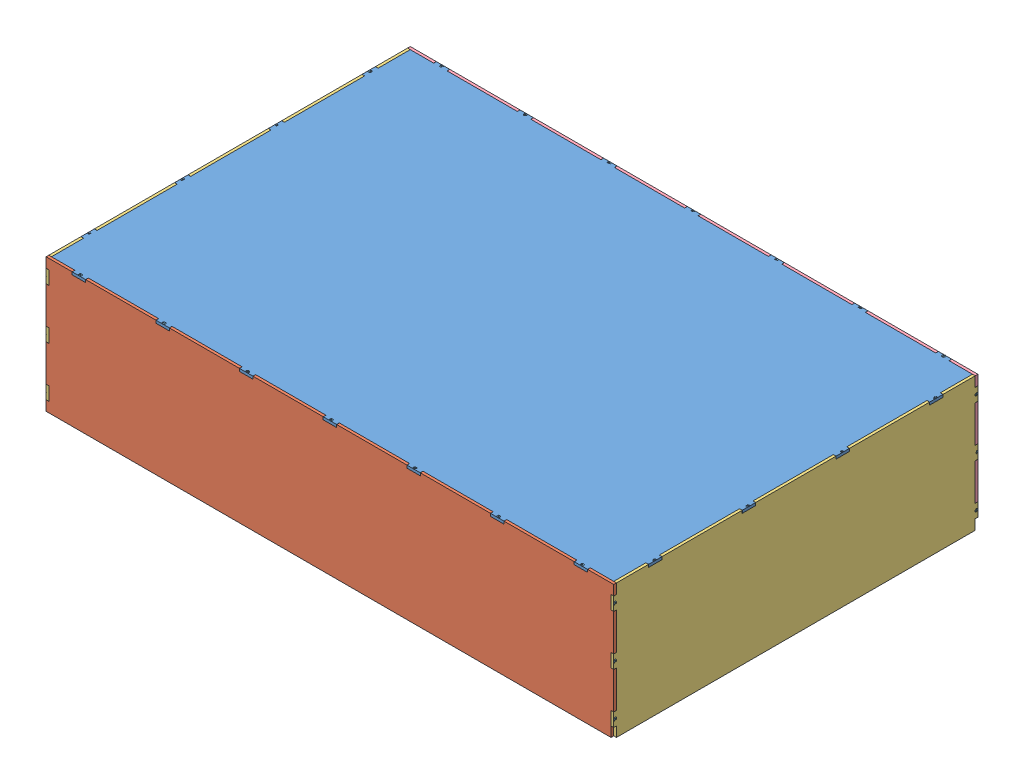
SolidWorks assembly 100094_Haube kpl..SLDASM, configuration Standard (file format 15000). Lengths in mm.
Overall size (850.13 200 546.13).
39 component instances, 5 part files, 18 mates.
Components (placement in the parent):
- 100090-1: 100090.SLDPRT [Standard] at origin size (848 4 544)
- 100091-1: 100091.SLDPRT [Standard] at (0 -96 268) size (848 200 4)
- 100092-1: 100092.SLDPRT [Standard] at (-420 -96 0) x (0 0 1) z (-1 0 0) size (544 200 4)
- 100092-2: 100092.SLDPRT [Standard] at (424 -96 0) x (0 0 1) z (-1 0 0) size (544 200 4)
- 100093-2: 100093.SLDPRT [Standard] at (0 -96 -272) size (848 200 4)
- Senkschraube m. I-6rd BN 4851-1: Senkschraube m. I-6rd BN 4851.SLDPRT [M2x8] at (416 -21 270) x (0 -1 0) z (0 0 1) size (4.4 8 4.4)
- Senkschraube m. I-6rd BN 4851-2: Senkschraube m. I-6rd BN 4851.SLDPRT [M2x8] at (375 -4 270) x (-0.818526 0 -0.574469) z (0.574469 0 -0.818526) size (4.4 8 4.4)
- Senkschraube m. I-6rd BN 4851-4: Senkschraube m. I-6rd BN 4851.SLDPRT [M2x8] at (-416 -21 270) x (0 0.104701 -0.994504) z (0 0.994504 0.104701) size (4.4 8 4.4)
- Senkschraube m. I-6rd BN 4851-6: Senkschraube m. I-6rd BN 4851.SLDPRT [M2x8] at (416 -171 270) x (0 -1 0) z (0 0 1) size (4.4 8 4.4)
- Senkschraube m. I-6rd BN 4851-7: Senkschraube m. I-6rd BN 4851.SLDPRT [M2x8] at (416 -96 270) x (0 -1 0) z (0 0 1) size (4.4 8 4.4)
- Senkschraube m. I-6rd BN 4851-8: Senkschraube m. I-6rd BN 4851.SLDPRT [M2x8] at (416 -21 -270) x (0 -1 0) z (0 0 1) size (4.4 8 4.4)
- Senkschraube m. I-6rd BN 4851-9: Senkschraube m. I-6rd BN 4851.SLDPRT [M2x8] at (416 -171 -270) x (0 -1 0) z (0 0 1) size (4.4 8 4.4)
- Senkschraube m. I-6rd BN 4851-10: Senkschraube m. I-6rd BN 4851.SLDPRT [M2x8] at (416 -96 -270) x (0 -1 0) z (0 0 1) size (4.4 8 4.4)
- Senkschraube m. I-6rd BN 4851-11: Senkschraube m. I-6rd BN 4851.SLDPRT [M2x8] at (-422 -4 -210) x (-0.818526 0 -0.574469) z (0.574469 0 -0.818526) size (4.4 8 4.4)
- Senkschraube m. I-6rd BN 4851-12: Senkschraube m. I-6rd BN 4851.SLDPRT [M2x8] at (-422 -4 -70) x (-0.818526 0 -0.574469) z (0.574469 0 -0.818526) size (4.4 8 4.4)
- Senkschraube m. I-6rd BN 4851-13: Senkschraube m. I-6rd BN 4851.SLDPRT [M2x8] at (-422 -4 70) x (-0.818526 0 -0.574469) z (0.574469 0 -0.818526) size (4.4 8 4.4)
- Senkschraube m. I-6rd BN 4851-14: Senkschraube m. I-6rd BN 4851.SLDPRT [M2x8] at (-422 -4 210) x (-0.818526 0 -0.574469) z (0.574469 0 -0.818526) size (4.4 8 4.4)
- Senkschraube m. I-6rd BN 4851-15: Senkschraube m. I-6rd BN 4851.SLDPRT [M2x8] at (-375 -4 270) x (-0.818526 0 -0.574469) z (0.574469 0 -0.818526) size (4.4 8 4.4)
- Senkschraube m. I-6rd BN 4851-16: Senkschraube m. I-6rd BN 4851.SLDPRT [M2x8] at (-250 -4 270) x (-0.818526 0 -0.574469) z (0.574469 0 -0.818526) size (4.4 8 4.4)
- Senkschraube m. I-6rd BN 4851-17: Senkschraube m. I-6rd BN 4851.SLDPRT [M2x8] at (-125 -4 270) x (-0.818526 0 -0.574469) z (0.574469 0 -0.818526) size (4.4 8 4.4)
- Senkschraube m. I-6rd BN 4851-18: Senkschraube m. I-6rd BN 4851.SLDPRT [M2x8] at (0 -4 270) x (-0.818526 0 -0.574469) z (0.574469 0 -0.818526) size (4.4 8 4.4)
- Senkschraube m. I-6rd BN 4851-19: Senkschraube m. I-6rd BN 4851.SLDPRT [M2x8] at (125 -4 270) x (-0.818526 0 -0.574469) z (0.574469 0 -0.818526) size (4.4 8 4.4)
- Senkschraube m. I-6rd BN 4851-20: Senkschraube m. I-6rd BN 4851.SLDPRT [M2x8] at (250 -4 270) x (-0.818526 0 -0.574469) z (0.574469 0 -0.818526) size (4.4 8 4.4)
- Senkschraube m. I-6rd BN 4851-21: Senkschraube m. I-6rd BN 4851.SLDPRT [M2x8] at (-375 -4 -270) x (-0.818526 0 -0.574469) z (0.574469 0 -0.818526) size (4.4 8 4.4)
- Senkschraube m. I-6rd BN 4851-22: Senkschraube m. I-6rd BN 4851.SLDPRT [M2x8] at (422 -4 210) x (-0.818526 0 -0.574469) z (0.574469 0 -0.818526) size (4.4 8 4.4)
- Senkschraube m. I-6rd BN 4851-23: Senkschraube m. I-6rd BN 4851.SLDPRT [M2x8] at (422 -4 70) x (-0.818526 0 -0.574469) z (0.574469 0 -0.818526) size (4.4 8 4.4)
- Senkschraube m. I-6rd BN 4851-24: Senkschraube m. I-6rd BN 4851.SLDPRT [M2x8] at (422 -4 -70) x (-0.818526 0 -0.574469) z (0.574469 0 -0.818526) size (4.4 8 4.4)
- Senkschraube m. I-6rd BN 4851-25: Senkschraube m. I-6rd BN 4851.SLDPRT [M2x8] at (422 -4 -210) x (-0.818526 0 -0.574469) z (0.574469 0 -0.818526) size (4.4 8 4.4)
- Senkschraube m. I-6rd BN 4851-26: Senkschraube m. I-6rd BN 4851.SLDPRT [M2x8] at (375 -4 -270) x (-0.818526 0 -0.574469) z (0.574469 0 -0.818526) size (4.4 8 4.4)
- Senkschraube m. I-6rd BN 4851-27: Senkschraube m. I-6rd BN 4851.SLDPRT [M2x8] at (250 -4 -270) x (-0.818526 0 -0.574469) z (0.574469 0 -0.818526) size (4.4 8 4.4)
- Senkschraube m. I-6rd BN 4851-28: Senkschraube m. I-6rd BN 4851.SLDPRT [M2x8] at (125 -4 -270) x (-0.818526 0 -0.574469) z (0.574469 0 -0.818526) size (4.4 8 4.4)
- Senkschraube m. I-6rd BN 4851-29: Senkschraube m. I-6rd BN 4851.SLDPRT [M2x8] at (0 -4 -270) x (-0.818526 0 -0.574469) z (0.574469 0 -0.818526) size (4.4 8 4.4)
- Senkschraube m. I-6rd BN 4851-30: Senkschraube m. I-6rd BN 4851.SLDPRT [M2x8] at (-125 -4 -270) x (-0.818526 0 -0.574469) z (0.574469 0 -0.818526) size (4.4 8 4.4)
- Senkschraube m. I-6rd BN 4851-31: Senkschraube m. I-6rd BN 4851.SLDPRT [M2x8] at (-250 -4 -270) x (-0.818526 0 -0.574469) z (0.574469 0 -0.818526) size (4.4 8 4.4)
- Senkschraube m. I-6rd BN 4851-32: Senkschraube m. I-6rd BN 4851.SLDPRT [M2x8] at (-416 -171 270) x (0 0.104701 -0.994504) z (0 0.994504 0.104701) size (4.4 8 4.4)
- Senkschraube m. I-6rd BN 4851-33: Senkschraube m. I-6rd BN 4851.SLDPRT [M2x8] at (-416 -96 270) x (0 0.104701 -0.994504) z (0 0.994504 0.104701) size (4.4 8 4.4)
- Senkschraube m. I-6rd BN 4851-34: Senkschraube m. I-6rd BN 4851.SLDPRT [M2x8] at (-416 -21 -270) x (0 0.104701 -0.994504) z (0 0.994504 0.104701) size (4.4 8 4.4)
- Senkschraube m. I-6rd BN 4851-35: Senkschraube m. I-6rd BN 4851.SLDPRT [M2x8] at (-416 -171 -270) x (0 0.104701 -0.994504) z (0 0.994504 0.104701) size (4.4 8 4.4)
- Senkschraube m. I-6rd BN 4851-36: Senkschraube m. I-6rd BN 4851.SLDPRT [M2x8] at (-416 -96 -270) x (0 0.104701 -0.994504) z (0 0.994504 0.104701) size (4.4 8 4.4)
Mates (geometry in assembly coordinates):
- Deckungsgleich1: coincident aligned: plane of Haube Oben-1 through (-424 4 272) normal (0 0 1); plane of Haube vorne-1 through (0 -96 272) normal (0 0 1)
- Deckungsgleich2: coincident aligned: plane of Haube Oben-1 through (0 4 0) normal (0 1 0); plane of Haube vorne-1 through (-424 4 272) normal (0 1 0)
- Deckungsgleich3: coincident aligned: plane of Haube Oben-1 through (-424 4 272) normal (-1 0 0); plane of Haube vorne-1 through (-424 -196 272) normal (-1 0 0)
- Deckungsgleich4: coincident aligned: plane of Haube vorne-1 through (0 -96 272) normal (0 0 1); plane of Haube Seite-1 through (-424 -196 272) normal (0 0 1)
- Deckungsgleich5: coincident aligned: plane of Haube Oben-1 through (0 4 0) normal (0 1 0); plane of Haube Seite-1 through (-424 4 -272) normal (0 1 0)
- Deckungsgleich6: coincident aligned: plane of Haube Oben-1 through (-424 4 272) normal (-1 0 0); plane of Haube Seite-1 through (-424 -96 0) normal (-1 0 0)
- Deckungsgleich7: coincident aligned: plane of Haube vorne-1 through (0 -96 272) normal (0 0 1); plane of Haube Seite-2 through (420 -196 272) normal (0 0 1)
- Deckungsgleich8: coincident aligned: plane of Haube Oben-1 through (0 4 0) normal (0 1 0); plane of Haube Seite-2 through (420 4 -272) normal (0 1 0)
- Deckungsgleich9: coincident aligned: plane of Haube Oben-1 through (424 4 272) normal (1 0 0); plane of Haube Seite-2 through (424 -96 0) normal (1 0 0)
- Deckungsgleich10: coincident aligned: plane of Haube Oben-1 through (0 4 0) normal (0 1 0); plane of Haube hinten-2 through (-424 4 -268) normal (0 1 0)
- Deckungsgleich11: coincident aligned: plane of Haube Oben-1 through (-424 4 272) normal (-1 0 0); plane of Haube hinten-2 through (-424 -196 -268) normal (-1 0 0)
- Deckungsgleich12: coincident aligned: plane of Haube Oben-1 through (-424 4 -272) normal (0 0 -1); plane of Haube hinten-2 through (0 -96 -272) normal (0 0 -1)
- Konzentrisch11: concentric aligned: cylinder of 100092-2 through (420 -21 270) axis (-1 0 0) radius 1; cone of Senkschraube m. I-6rd BN 4851-1 through (422.8 -21 270) axis (-1 0 0)
- Deckungsgleich13: coincident aligned: plane of 100092-2 through (424 -96 0) normal (1 0 0); plane of Senkschraube m. I-6rd BN 4851-1 through (424 -21 270) normal (1 0 0)
- Konzentrisch2: concentric anti-aligned: cylinder of 100090-1 through (375 4 270) axis (0 1 0) radius 1; cone of Senkschraube m. I-6rd BN 4851-2 through (375 2.8 270) axis (0 -1 0)
- Deckungsgleich14: coincident aligned: plane of 100090-1 through (0 4 0) normal (0 1 0); plane of Senkschraube m. I-6rd BN 4851-2 through (375 4 270) normal (0 1 0)
- Konzentrisch3: concentric anti-aligned: cylinder of 100092-1 through (-424 -21 270) axis (-1 0 0) radius 1; cone of Senkschraube m. I-6rd BN 4851-4 through (-422.8 -21 270) axis (1 0 0)
- Deckungsgleich15: coincident aligned: plane of 100092-1 through (-424 -96 0) normal (-1 0 0); plane of Senkschraube m. I-6rd BN 4851-4 through (-424 -21 270) normal (-1 0 0)
